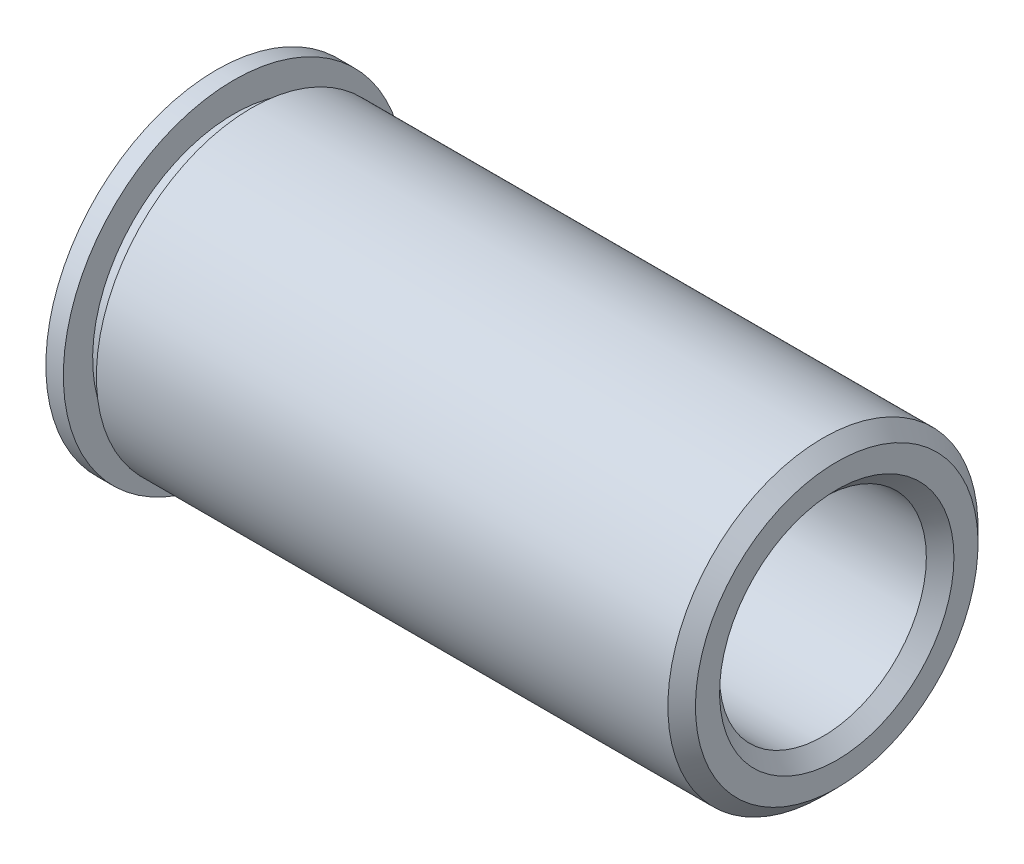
ISO-10303-21;
HEADER;
FILE_DESCRIPTION(('STEP AP214'),'2;1');
FILE_NAME('part.step','',(''),(''),'','','');
FILE_SCHEMA(('AUTOMOTIVE_DESIGN { 1 0 10303 214 1 1 1 1 }'));
ENDSEC;
DATA;
#1=APPLICATION_CONTEXT('core data for automotive mechanical design processes');
#2=APPLICATION_PROTOCOL_DEFINITION('international standard','automotive_design',2000,#1);
#3=PRODUCT_CONTEXT('',#1,'mechanical');
#4=PRODUCT('Part','Part','',(#3));
#5=PRODUCT_RELATED_PRODUCT_CATEGORY('part','',(#4));
#6=PRODUCT_DEFINITION_FORMATION('','',#4);
#7=PRODUCT_DEFINITION_CONTEXT('part definition',#1,'design');
#8=PRODUCT_DEFINITION('design','',#6,#7);
#9=PRODUCT_DEFINITION_SHAPE('','',#8);
#10=(LENGTH_UNIT() NAMED_UNIT(*) SI_UNIT(.MILLI.,.METRE.));
#11=(NAMED_UNIT(*) PLANE_ANGLE_UNIT() SI_UNIT($,.RADIAN.));
#12=(NAMED_UNIT(*) SI_UNIT($,.STERADIAN.) SOLID_ANGLE_UNIT());
#13=UNCERTAINTY_MEASURE_WITH_UNIT(LENGTH_MEASURE(1.E-05),#10,'distance_accuracy_value','');
#14=(GEOMETRIC_REPRESENTATION_CONTEXT(3) GLOBAL_UNCERTAINTY_ASSIGNED_CONTEXT((#13)) GLOBAL_UNIT_ASSIGNED_CONTEXT((#10,
#11,#12)) REPRESENTATION_CONTEXT('',''));
#15=CARTESIAN_POINT('',(0.,0.,0.));
#16=DIRECTION('',(0.,0.,1.));
#17=DIRECTION('',(1.,0.,0.));
#18=AXIS2_PLACEMENT_3D('',#15,#16,#17);
#19=CARTESIAN_POINT('',(78.2136725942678,0.,0.));
#20=DIRECTION('',(-1.,0.,0.));
#21=DIRECTION('',(0.,-1.,0.));
#22=AXIS2_PLACEMENT_3D('',#19,#20,#21);
#23=PLANE('',#22);
#24=CARTESIAN_POINT('',(78.2136725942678,0.,0.));
#25=DIRECTION('',(-1.,0.,0.));
#26=DIRECTION('',(0.,-1.,0.));
#27=AXIS2_PLACEMENT_3D('',#24,#25,#26);
#28=CIRCLE('',#27,1.7);
#29=CARTESIAN_POINT('',(78.2136725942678,-1.7,0.));
#30=VERTEX_POINT('',#29);
#31=EDGE_CURVE('E10',#30,#30,#28,.T.);
#32=ORIENTED_EDGE('',*,*,#31,.T.);
#33=EDGE_LOOP('',(#32));
#34=FACE_BOUND('',#33,.T.);
#35=CARTESIAN_POINT('',(78.2136725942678,0.,0.));
#36=DIRECTION('',(-1.,0.,0.));
#37=DIRECTION('',(0.,-1.,0.));
#38=AXIS2_PLACEMENT_3D('',#35,#36,#37);
#39=CIRCLE('',#38,2.05000000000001);
#40=CARTESIAN_POINT('',(78.2136725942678,-2.05,0.));
#41=VERTEX_POINT('',#40);
#42=EDGE_CURVE('E54',#41,#41,#39,.F.);
#43=ORIENTED_EDGE('',*,*,#42,.T.);
#44=EDGE_LOOP('',(#43));
#45=FACE_BOUND('',#44,.T.);
#46=ADVANCED_FACE('F34',(#34,#45),#23,.F.);
#47=CARTESIAN_POINT('',(-67.8249023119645,0.,0.));
#48=DIRECTION('',(-1.,0.,0.));
#49=DIRECTION('',(0.,-1.,0.));
#50=AXIS2_PLACEMENT_3D('',#47,#48,#49);
#51=CYLINDRICAL_SURFACE('',#50,2.25);
#52=CARTESIAN_POINT('',(78.0136725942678,0.,0.));
#53=DIRECTION('',(-1.,0.,0.));
#54=DIRECTION('',(0.,-1.,0.));
#55=AXIS2_PLACEMENT_3D('',#52,#53,#54);
#56=CIRCLE('',#55,2.25);
#57=CARTESIAN_POINT('',(78.0136725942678,-2.24999999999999,0.));
#58=VERTEX_POINT('',#57);
#59=EDGE_CURVE('E57',#58,#58,#56,.T.);
#60=ORIENTED_EDGE('',*,*,#59,.T.);
#61=EDGE_LOOP('',(#60));
#62=FACE_BOUND('',#61,.T.);
#63=CARTESIAN_POINT('',(69.7216725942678,0.,0.));
#64=DIRECTION('',(-1.,0.,0.));
#65=DIRECTION('',(0.,-1.,0.));
#66=AXIS2_PLACEMENT_3D('',#63,#64,#65);
#67=CIRCLE('',#66,2.25);
#68=CARTESIAN_POINT('',(69.7216725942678,-2.25,0.));
#69=VERTEX_POINT('',#68);
#70=EDGE_CURVE('E60',#69,#69,#67,.T.);
#71=ORIENTED_EDGE('',*,*,#70,.F.);
#72=EDGE_LOOP('',(#71));
#73=FACE_BOUND('',#72,.T.);
#74=ADVANCED_FACE('F99',(#62,#73),#51,.T.);
#75=CARTESIAN_POINT('',(69.7216725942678,2.25,0.));
#76=DIRECTION('',(1.,0.,0.));
#77=DIRECTION('',(0.,1.,0.));
#78=AXIS2_PLACEMENT_3D('',#75,#76,#77);
#79=PLANE('',#78);
#80=CARTESIAN_POINT('',(69.7216725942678,0.,0.));
#81=DIRECTION('',(-1.,0.,0.));
#82=DIRECTION('',(0.,-1.,0.));
#83=AXIS2_PLACEMENT_3D('',#80,#81,#82);
#84=CIRCLE('',#83,2.05);
#85=CARTESIAN_POINT('',(69.7216725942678,-2.05,0.));
#86=VERTEX_POINT('',#85);
#87=EDGE_CURVE('E63',#86,#86,#84,.T.);
#88=ORIENTED_EDGE('',*,*,#87,.F.);
#89=EDGE_LOOP('',(#88));
#90=FACE_BOUND('',#89,.T.);
#91=ORIENTED_EDGE('',*,*,#70,.T.);
#92=EDGE_LOOP('',(#91));
#93=FACE_BOUND('',#92,.T.);
#94=ADVANCED_FACE('F93',(#90,#93),#79,.F.);
#95=CARTESIAN_POINT('',(-67.8249023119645,0.,0.));
#96=DIRECTION('',(-1.,0.,0.));
#97=DIRECTION('',(0.,-1.,0.));
#98=AXIS2_PLACEMENT_3D('',#95,#96,#97);
#99=CYLINDRICAL_SURFACE('',#98,2.05);
#100=CARTESIAN_POINT('',(69.4676725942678,0.,0.));
#101=DIRECTION('',(-1.,0.,0.));
#102=DIRECTION('',(0.,-1.,0.));
#103=AXIS2_PLACEMENT_3D('',#100,#101,#102);
#104=CIRCLE('',#103,2.05);
#105=CARTESIAN_POINT('',(69.4676725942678,-2.05,0.));
#106=VERTEX_POINT('',#105);
#107=EDGE_CURVE('E66',#106,#106,#104,.T.);
#108=ORIENTED_EDGE('',*,*,#107,.F.);
#109=EDGE_LOOP('',(#108));
#110=FACE_BOUND('',#109,.T.);
#111=ORIENTED_EDGE('',*,*,#87,.T.);
#112=EDGE_LOOP('',(#111));
#113=FACE_BOUND('',#112,.T.);
#114=ADVANCED_FACE('F87',(#110,#113),#99,.T.);
#115=CARTESIAN_POINT('',(69.4676725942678,2.05,0.));
#116=DIRECTION('',(-1.,0.,0.));
#117=DIRECTION('',(0.,-1.,0.));
#118=AXIS2_PLACEMENT_3D('',#115,#116,#117);
#119=PLANE('',#118);
#120=CARTESIAN_POINT('',(69.4676725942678,0.,0.));
#121=DIRECTION('',(-1.,0.,0.));
#122=DIRECTION('',(0.,-1.,0.));
#123=AXIS2_PLACEMENT_3D('',#120,#121,#122);
#124=CIRCLE('',#123,2.475);
#125=CARTESIAN_POINT('',(69.4676725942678,-2.475,0.));
#126=VERTEX_POINT('',#125);
#127=EDGE_CURVE('E69',#126,#126,#124,.T.);
#128=ORIENTED_EDGE('',*,*,#127,.F.);
#129=EDGE_LOOP('',(#128));
#130=FACE_BOUND('',#129,.T.);
#131=ORIENTED_EDGE('',*,*,#107,.T.);
#132=EDGE_LOOP('',(#131));
#133=FACE_BOUND('',#132,.T.);
#134=ADVANCED_FACE('F81',(#130,#133),#119,.F.);
#135=CARTESIAN_POINT('',(-67.8249023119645,0.,0.));
#136=DIRECTION('',(-1.,0.,0.));
#137=DIRECTION('',(0.,-1.,0.));
#138=AXIS2_PLACEMENT_3D('',#135,#136,#137);
#139=CYLINDRICAL_SURFACE('',#138,2.475);
#140=CARTESIAN_POINT('',(69.2136725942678,0.,0.));
#141=DIRECTION('',(-1.,0.,0.));
#142=DIRECTION('',(0.,-1.,0.));
#143=AXIS2_PLACEMENT_3D('',#140,#141,#142);
#144=CIRCLE('',#143,2.475);
#145=CARTESIAN_POINT('',(69.2136725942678,-2.475,0.));
#146=VERTEX_POINT('',#145);
#147=EDGE_CURVE('E72',#146,#146,#144,.T.);
#148=ORIENTED_EDGE('',*,*,#147,.F.);
#149=EDGE_LOOP('',(#148));
#150=FACE_BOUND('',#149,.T.);
#151=ORIENTED_EDGE('',*,*,#127,.T.);
#152=EDGE_LOOP('',(#151));
#153=FACE_BOUND('',#152,.T.);
#154=ADVANCED_FACE('F78',(#150,#153),#139,.T.);
#155=CARTESIAN_POINT('',(69.2136725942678,2.475,0.));
#156=DIRECTION('',(1.,0.,0.));
#157=DIRECTION('',(0.,1.,0.));
#158=AXIS2_PLACEMENT_3D('',#155,#156,#157);
#159=PLANE('',#158);
#160=CARTESIAN_POINT('',(69.2136725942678,0.,0.));
#161=DIRECTION('',(1.,0.,0.));
#162=DIRECTION('',(0.,1.,0.));
#163=AXIS2_PLACEMENT_3D('',#160,#161,#162);
#164=CIRCLE('',#163,1.70000000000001);
#165=CARTESIAN_POINT('',(69.2136725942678,1.70000000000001,0.));
#166=VERTEX_POINT('',#165);
#167=EDGE_CURVE('E49',#166,#166,#164,.T.);
#168=ORIENTED_EDGE('',*,*,#167,.T.);
#169=EDGE_LOOP('',(#168));
#170=FACE_BOUND('',#169,.T.);
#171=ORIENTED_EDGE('',*,*,#147,.T.);
#172=EDGE_LOOP('',(#171));
#173=FACE_BOUND('',#172,.T.);
#174=ADVANCED_FACE('F76',(#170,#173),#159,.F.);
#175=CARTESIAN_POINT('',(69.2136725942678,0.,0.));
#176=DIRECTION('',(1.,0.,0.));
#177=DIRECTION('',(0.,0.,-1.));
#178=AXIS2_PLACEMENT_3D('',#175,#176,#177);
#179=CYLINDRICAL_SURFACE('',#178,1.5);
#180=CARTESIAN_POINT('',(69.4136725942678,0.,0.));
#181=DIRECTION('',(1.,0.,0.));
#182=DIRECTION('',(0.,0.,-1.));
#183=AXIS2_PLACEMENT_3D('',#180,#181,#182);
#184=CIRCLE('',#183,1.5);
#185=CARTESIAN_POINT('',(69.4136725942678,0.,-1.5));
#186=VERTEX_POINT('',#185);
#187=EDGE_CURVE('E41',#186,#186,#184,.F.);
#188=ORIENTED_EDGE('',*,*,#187,.T.);
#189=EDGE_LOOP('',(#188));
#190=FACE_BOUND('',#189,.T.);
#191=CARTESIAN_POINT('',(78.0136725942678,0.,0.));
#192=DIRECTION('',(-1.,0.,0.));
#193=DIRECTION('',(0.,0.,1.));
#194=AXIS2_PLACEMENT_3D('',#191,#192,#193);
#195=CIRCLE('',#194,1.5);
#196=CARTESIAN_POINT('',(78.0136725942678,0.,1.5));
#197=VERTEX_POINT('',#196);
#198=EDGE_CURVE('E45',#197,#197,#195,.F.);
#199=ORIENTED_EDGE('',*,*,#198,.T.);
#200=EDGE_LOOP('',(#199));
#201=FACE_BOUND('',#200,.T.);
#202=ADVANCED_FACE('F114',(#190,#201),#179,.F.);
#203=CARTESIAN_POINT('',(78.0136725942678,0.,0.));
#204=DIRECTION('',(-1.,0.,0.));
#205=DIRECTION('',(0.,-1.,0.));
#206=AXIS2_PLACEMENT_3D('',#203,#204,#205);
#207=CONICAL_SURFACE('',#206,2.25,0.785398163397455);
#208=CARTESIAN_POINT('',(78.2136725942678,-2.05,0.));
#209=CARTESIAN_POINT('',(78.2115892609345,-2.05208333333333,0.));
#210=CARTESIAN_POINT('',(78.2095059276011,-2.05416666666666,0.));
#211=CARTESIAN_POINT('',(78.2053392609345,-2.05833333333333,0.));
#212=CARTESIAN_POINT('',(78.2032559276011,-2.06041666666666,0.));
#213=CARTESIAN_POINT('',(78.1990892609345,-2.06458333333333,0.));
#214=CARTESIAN_POINT('',(78.1970059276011,-2.06666666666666,0.));
#215=CARTESIAN_POINT('',(78.1928392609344,-2.07083333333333,0.));
#216=CARTESIAN_POINT('',(78.1907559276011,-2.07291666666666,0.));
#217=CARTESIAN_POINT('',(78.1865892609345,-2.07708333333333,0.));
#218=CARTESIAN_POINT('',(78.1845059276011,-2.07916666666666,0.));
#219=CARTESIAN_POINT('',(78.1803392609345,-2.08333333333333,0.));
#220=CARTESIAN_POINT('',(78.1782559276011,-2.08541666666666,0.));
#221=CARTESIAN_POINT('',(78.1740892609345,-2.08958333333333,0.));
#222=CARTESIAN_POINT('',(78.1720059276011,-2.09166666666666,0.));
#223=CARTESIAN_POINT('',(78.1678392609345,-2.09583333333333,0.));
#224=CARTESIAN_POINT('',(78.1657559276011,-2.09791666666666,0.));
#225=CARTESIAN_POINT('',(78.1615892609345,-2.10208333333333,0.));
#226=CARTESIAN_POINT('',(78.1595059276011,-2.10416666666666,0.));
#227=CARTESIAN_POINT('',(78.1553392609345,-2.10833333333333,0.));
#228=CARTESIAN_POINT('',(78.1532559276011,-2.11041666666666,0.));
#229=CARTESIAN_POINT('',(78.1490892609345,-2.11458333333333,0.));
#230=CARTESIAN_POINT('',(78.1470059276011,-2.11666666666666,0.));
#231=CARTESIAN_POINT('',(78.1428392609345,-2.12083333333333,0.));
#232=CARTESIAN_POINT('',(78.1407559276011,-2.12291666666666,0.));
#233=CARTESIAN_POINT('',(78.1365892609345,-2.12708333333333,0.));
#234=CARTESIAN_POINT('',(78.1345059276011,-2.12916666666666,0.));
#235=CARTESIAN_POINT('',(78.1303392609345,-2.13333333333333,0.));
#236=CARTESIAN_POINT('',(78.1282559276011,-2.13541666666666,0.));
#237=CARTESIAN_POINT('',(78.1240892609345,-2.13958333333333,0.));
#238=CARTESIAN_POINT('',(78.1220059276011,-2.14166666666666,0.));
#239=CARTESIAN_POINT('',(78.1178392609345,-2.14583333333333,0.));
#240=CARTESIAN_POINT('',(78.1157559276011,-2.14791666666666,0.));
#241=CARTESIAN_POINT('',(78.1115892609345,-2.15208333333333,0.));
#242=CARTESIAN_POINT('',(78.1095059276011,-2.15416666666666,0.));
#243=CARTESIAN_POINT('',(78.1053392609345,-2.15833333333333,0.));
#244=CARTESIAN_POINT('',(78.1032559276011,-2.16041666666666,0.));
#245=CARTESIAN_POINT('',(78.0990892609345,-2.16458333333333,0.));
#246=CARTESIAN_POINT('',(78.0970059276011,-2.16666666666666,0.));
#247=CARTESIAN_POINT('',(78.0928392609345,-2.17083333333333,0.));
#248=CARTESIAN_POINT('',(78.0907559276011,-2.17291666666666,0.));
#249=CARTESIAN_POINT('',(78.0865892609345,-2.17708333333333,0.));
#250=CARTESIAN_POINT('',(78.0845059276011,-2.17916666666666,0.));
#251=CARTESIAN_POINT('',(78.0803392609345,-2.18333333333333,0.));
#252=CARTESIAN_POINT('',(78.0782559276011,-2.18541666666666,0.));
#253=CARTESIAN_POINT('',(78.0740892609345,-2.18958333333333,0.));
#254=CARTESIAN_POINT('',(78.0720059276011,-2.19166666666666,0.));
#255=CARTESIAN_POINT('',(78.0678392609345,-2.19583333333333,0.));
#256=CARTESIAN_POINT('',(78.0657559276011,-2.19791666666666,0.));
#257=CARTESIAN_POINT('',(78.0615892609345,-2.20208333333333,0.));
#258=CARTESIAN_POINT('',(78.0595059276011,-2.20416666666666,0.));
#259=CARTESIAN_POINT('',(78.0553392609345,-2.20833333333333,0.));
#260=CARTESIAN_POINT('',(78.0532559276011,-2.21041666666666,0.));
#261=CARTESIAN_POINT('',(78.0490892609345,-2.21458333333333,0.));
#262=CARTESIAN_POINT('',(78.0470059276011,-2.21666666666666,0.));
#263=CARTESIAN_POINT('',(78.0428392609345,-2.22083333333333,0.));
#264=CARTESIAN_POINT('',(78.0407559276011,-2.22291666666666,0.));
#265=CARTESIAN_POINT('',(78.0365892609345,-2.22708333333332,0.));
#266=CARTESIAN_POINT('',(78.0345059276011,-2.22916666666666,0.));
#267=CARTESIAN_POINT('',(78.0303392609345,-2.23333333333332,0.));
#268=CARTESIAN_POINT('',(78.0282559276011,-2.23541666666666,0.));
#269=CARTESIAN_POINT('',(78.0240892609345,-2.23958333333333,0.));
#270=CARTESIAN_POINT('',(78.0220059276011,-2.24166666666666,0.));
#271=CARTESIAN_POINT('',(78.0178392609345,-2.24583333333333,0.));
#272=CARTESIAN_POINT('',(78.0157559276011,-2.24791666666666,0.));
#273=CARTESIAN_POINT('',(78.0136725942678,-2.24999999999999,0.));
#274=B_SPLINE_CURVE_WITH_KNOTS('',3,(#208,#209,#210,#211,#212,#213,#214,#215,#216,#217,#218,
#219,#220,#221,#222,#223,#224,#225,#226,#227,#228,#229,#230,#231,#232,#233,#234,#235,#236,#237,
#238,#239,#240,#241,#242,#243,#244,#245,#246,#247,#248,#249,#250,#251,#252,#253,#254,#255,#256,
#257,#258,#259,#260,#261,#262,#263,#264,#265,#266,#267,#268,#269,#270,#271,#272,#273),
.UNSPECIFIED.,.F.,.F.,(4,2,2,2,2,2,2,2,2,2,2,2,2,2,2,2,2,2,2,2,2,2,2,2,2,2,2,2,2,2,2,2,4),(0.,
0.00883883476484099,0.0176776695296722,0.0265165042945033,0.0353553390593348,0.044194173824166,
0.0530330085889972,0.0618718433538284,0.0707106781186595,0.079549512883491,0.0883883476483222,
0.0972271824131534,0.106066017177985,0.114904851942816,0.123743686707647,0.132582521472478,
0.14142135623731,0.150260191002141,0.159099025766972,0.167937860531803,0.176776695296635,
0.185615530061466,0.194454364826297,0.203293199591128,0.212132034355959,0.220970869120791,
0.229809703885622,0.238648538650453,0.247487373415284,0.256326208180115,0.265165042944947,
0.274003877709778,0.282842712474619),.UNSPECIFIED.);
#275=EDGE_CURVE('BSEAM111',#41,#58,#274,.T.);
#276=ORIENTED_EDGE('',*,*,#42,.F.);
#277=ORIENTED_EDGE('',*,*,#59,.F.);
#278=ORIENTED_EDGE('',*,*,#275,.T.);
#279=ORIENTED_EDGE('',*,*,#275,.F.);
#280=EDGE_LOOP('',(#276,#278,#277,#279));
#281=FACE_BOUND('',#280,.T.);
#282=ADVANCED_FACE('F111',(#281),#207,.T.);
#283=CARTESIAN_POINT('',(69.2136725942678,0.,0.));
#284=DIRECTION('',(-1.,0.,0.));
#285=DIRECTION('',(0.,0.,1.));
#286=AXIS2_PLACEMENT_3D('',#283,#284,#285);
#287=CONICAL_SURFACE('',#286,1.70000000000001,0.785398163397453);
#288=ORIENTED_EDGE('',*,*,#187,.F.);
#289=EDGE_LOOP('',(#288));
#290=FACE_BOUND('',#289,.T.);
#291=ORIENTED_EDGE('',*,*,#167,.F.);
#292=EDGE_LOOP('',(#291));
#293=FACE_BOUND('',#292,.T.);
#294=ADVANCED_FACE('F113',(#290,#293),#287,.F.);
#295=CARTESIAN_POINT('',(78.0136725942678,0.,0.));
#296=DIRECTION('',(1.,0.,0.));
#297=DIRECTION('',(0.,0.,-1.));
#298=AXIS2_PLACEMENT_3D('',#295,#296,#297);
#299=CONICAL_SURFACE('',#298,1.5,0.785398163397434);
#300=ORIENTED_EDGE('',*,*,#31,.F.);
#301=EDGE_LOOP('',(#300));
#302=FACE_BOUND('',#301,.T.);
#303=ORIENTED_EDGE('',*,*,#198,.F.);
#304=EDGE_LOOP('',(#303));
#305=FACE_BOUND('',#304,.T.);
#306=ADVANCED_FACE('F36',(#302,#305),#299,.F.);
#307=CLOSED_SHELL('',(#46,#74,#94,#114,#134,#154,#174,#202,#282,#294,#306));
#308=MANIFOLD_SOLID_BREP('B2',#307);
#309=ADVANCED_BREP_SHAPE_REPRESENTATION('',(#18,#308),#14);
#310=SHAPE_DEFINITION_REPRESENTATION(#9,#309);
ENDSEC;
END-ISO-10303-21;
